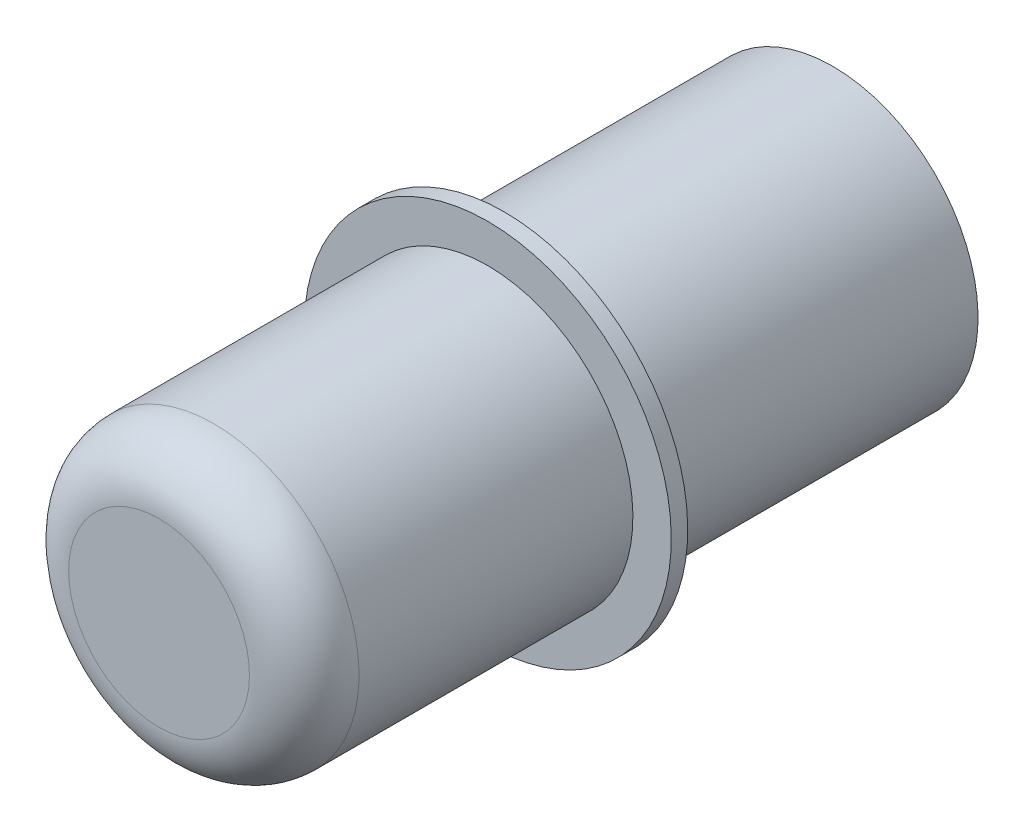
from build123d import *

# Parameters (mm, degrees)
CONG_1_R                = 5
ESQUISSE2_R             = 7
ENL_V_MAT_EXTRU_1_DEPTH = 18


with BuildPart() as part:
    # Esquisse1 → R_volution1 (revolve)
    with BuildSketch(Plane(origin=(0, 0, 0), x_dir=(0, 0, -1), z_dir=(1, 0, 0))):
        Polygon((0, 0), (0, 13.25), (30, 13.25), (30, 16.75), (31.5, 16.75), (31.5, 13.25), (61.5, 13.25), (61.5, 0), align=None)
    revolve(axis=Axis((0, 0, -61.5), (0, 0, 1)))

    # Cong_1
    cong_1_edges = [part.edges().sort_by_distance(p)[0] for p in [
        (0, -13.25, 0),
    ]]
    fillet(cong_1_edges, radius=CONG_1_R)

    # Esquisse2 → Enl_v. mat.-Extru.1 (cut)
    with BuildSketch(Plane(origin=(0, 0, -61.5), x_dir=(-1, 0, 0), z_dir=(0, 0, -1))):
        with Locations(Location((0, 0, 0), (0, 0, 90))):
            Circle(ESQUISSE2_R)
    extrude(amount=-ENL_V_MAT_EXTRU_1_DEPTH, mode=Mode.SUBTRACT)


solid = part.part
